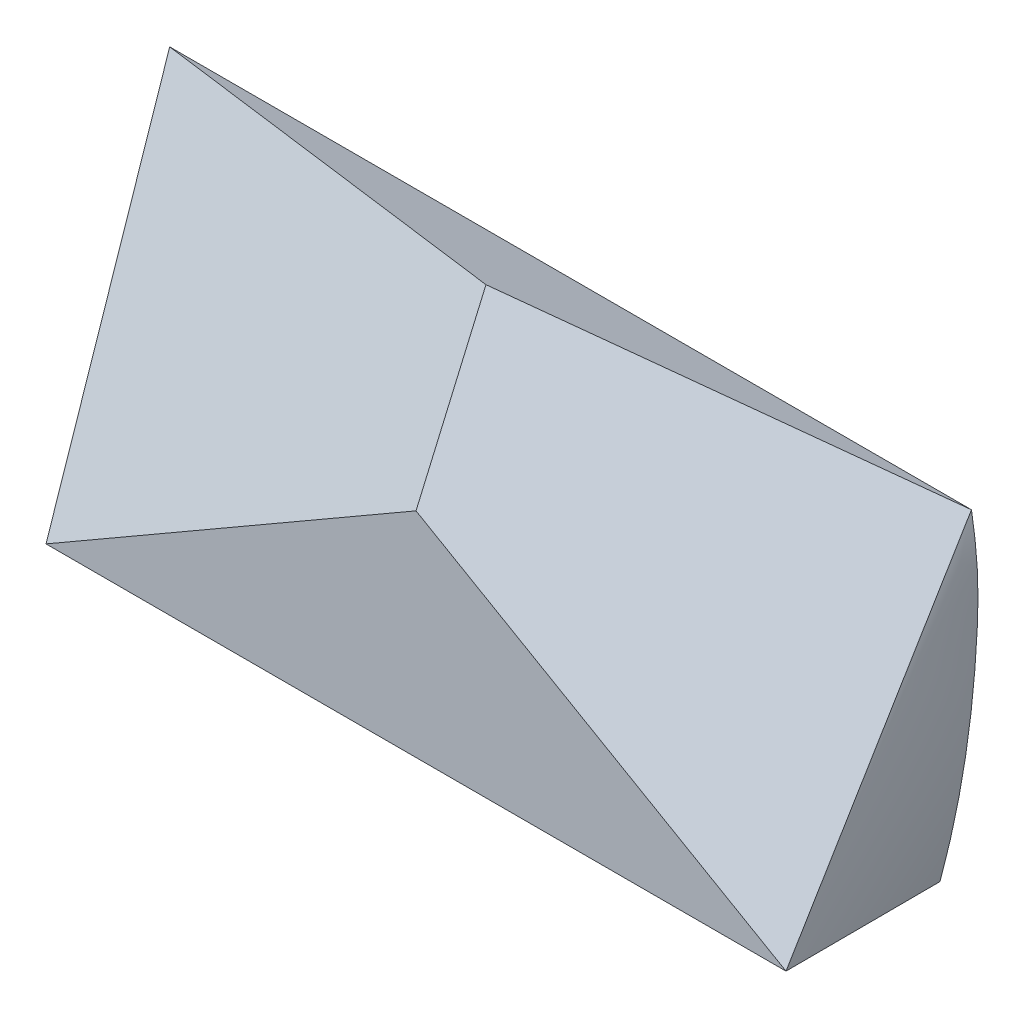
ISO-10303-21;
HEADER;
FILE_DESCRIPTION(('STEP AP214'),'2;1');
FILE_NAME('part.step','',(''),(''),'','','');
FILE_SCHEMA(('AUTOMOTIVE_DESIGN { 1 0 10303 214 1 1 1 1 }'));
ENDSEC;
DATA;
#1=APPLICATION_CONTEXT('core data for automotive mechanical design processes');
#2=APPLICATION_PROTOCOL_DEFINITION('international standard','automotive_design',2000,#1);
#3=PRODUCT_CONTEXT('',#1,'mechanical');
#4=PRODUCT('Part','Part','',(#3));
#5=PRODUCT_RELATED_PRODUCT_CATEGORY('part','',(#4));
#6=PRODUCT_DEFINITION_FORMATION('','',#4);
#7=PRODUCT_DEFINITION_CONTEXT('part definition',#1,'design');
#8=PRODUCT_DEFINITION('design','',#6,#7);
#9=PRODUCT_DEFINITION_SHAPE('','',#8);
#10=(LENGTH_UNIT() NAMED_UNIT(*) SI_UNIT(.MILLI.,.METRE.));
#11=(NAMED_UNIT(*) PLANE_ANGLE_UNIT() SI_UNIT($,.RADIAN.));
#12=(NAMED_UNIT(*) SI_UNIT($,.STERADIAN.) SOLID_ANGLE_UNIT());
#13=UNCERTAINTY_MEASURE_WITH_UNIT(LENGTH_MEASURE(1.E-05),#10,'distance_accuracy_value','');
#14=(GEOMETRIC_REPRESENTATION_CONTEXT(3) GLOBAL_UNCERTAINTY_ASSIGNED_CONTEXT((#13)) GLOBAL_UNIT_ASSIGNED_CONTEXT((#10,
#11,#12)) REPRESENTATION_CONTEXT('',''));
#15=CARTESIAN_POINT('',(0.,0.,0.));
#16=DIRECTION('',(0.,0.,1.));
#17=DIRECTION('',(1.,0.,0.));
#18=AXIS2_PLACEMENT_3D('',#15,#16,#17);
#19=CARTESIAN_POINT('',(0.,34.9116,-107.7276));
#20=DIRECTION('',(0.,0.,1.));
#21=DIRECTION('',(1.,0.,0.));
#22=AXIS2_PLACEMENT_3D('',#19,#20,#21);
#23=PLANE('',#22);
#24=CARTESIAN_POINT('',(-17.6616644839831,38.1174632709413,-107.7276));
#25=CARTESIAN_POINT('',(-17.6997094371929,37.9053981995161,-107.7276));
#26=CARTESIAN_POINT('',(-17.7341651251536,37.6926833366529,-107.7276));
#27=CARTESIAN_POINT('',(-17.7956552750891,37.2664553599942,-107.7276));
#28=CARTESIAN_POINT('',(-17.8226989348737,37.0529435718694,-107.7276));
#29=CARTESIAN_POINT('',(-17.8692025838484,36.6252367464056,-107.7276));
#30=CARTESIAN_POINT('',(-17.8886676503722,36.41104226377,-107.7276));
#31=CARTESIAN_POINT('',(-17.9196266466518,35.982787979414,-107.7276));
#32=CARTESIAN_POINT('',(-17.9311467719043,35.7687300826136,-107.7276));
#33=CARTESIAN_POINT('',(-17.9461106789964,35.3402925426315,-107.7276));
#34=CARTESIAN_POINT('',(-17.9495530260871,35.1259128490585,-107.7276));
#35=CARTESIAN_POINT('',(-17.9491639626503,34.8043343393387,-107.7276));
#36=CARTESIAN_POINT('',(-17.9481081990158,34.6971219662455,-107.7276));
#37=CARTESIAN_POINT('',(-17.9443804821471,34.4827243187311,-107.7276));
#38=CARTESIAN_POINT('',(-17.9417085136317,34.3755390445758,-107.7276));
#39=CARTESIAN_POINT('',(-17.9348336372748,34.1529513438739,-107.7276));
#40=CARTESIAN_POINT('',(-17.9305286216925,34.0375521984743,-107.7276));
#41=CARTESIAN_POINT('',(-17.9207823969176,33.806802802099,-107.7276));
#42=CARTESIAN_POINT('',(-17.9153411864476,33.6914525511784,-107.7276));
#43=CARTESIAN_POINT('',(-17.8976663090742,33.345459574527,-107.7276));
#44=CARTESIAN_POINT('',(-17.8840817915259,33.1148857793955,-107.7276));
#45=CARTESIAN_POINT('',(-17.8540475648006,32.653913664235,-107.7276));
#46=CARTESIAN_POINT('',(-17.837597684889,32.4235153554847,-107.7276));
#47=CARTESIAN_POINT('',(-17.8016910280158,31.96295374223,-107.7276));
#48=CARTESIAN_POINT('',(-17.7822342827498,31.7327904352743,-107.7276));
#49=CARTESIAN_POINT('',(-17.7399298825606,31.272047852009,-107.7276));
#50=CARTESIAN_POINT('',(-17.7170718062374,31.0414695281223,-107.7276));
#51=CARTESIAN_POINT('',(-17.6678470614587,30.5807226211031,-107.7276));
#52=CARTESIAN_POINT('',(-17.6414809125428,30.3505539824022,-107.7276));
#53=CARTESIAN_POINT('',(-17.5855300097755,29.8906256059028,-107.7276));
#54=CARTESIAN_POINT('',(-17.5559454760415,29.660865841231,-107.7276));
#55=CARTESIAN_POINT('',(-17.4936746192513,29.2017702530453,-107.7276));
#56=CARTESIAN_POINT('',(-17.4609883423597,28.9724344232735,-107.7276));
#57=CARTESIAN_POINT('',(-17.391882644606,28.5108276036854,-107.7276));
#58=CARTESIAN_POINT('',(-17.3554148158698,28.2785638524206,-107.7276));
#59=CARTESIAN_POINT('',(-17.2791356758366,27.8145706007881,-107.7276));
#60=CARTESIAN_POINT('',(-17.2393241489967,27.5828411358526,-107.7276));
#61=CARTESIAN_POINT('',(-17.1563394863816,27.1199743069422,-107.7276));
#62=CARTESIAN_POINT('',(-17.1131662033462,26.8888369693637,-107.7276));
#63=CARTESIAN_POINT('',(-17.0234619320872,26.4272085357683,-107.7276));
#64=CARTESIAN_POINT('',(-16.976930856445,26.1967174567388,-107.7276));
#65=CARTESIAN_POINT('',(-16.8807974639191,25.7377038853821,-107.7276));
#66=CARTESIAN_POINT('',(-16.8312135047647,25.5091775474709,-107.7276));
#67=CARTESIAN_POINT('',(-16.7287881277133,25.0528626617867,-107.7276));
#68=CARTESIAN_POINT('',(-16.6759467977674,24.8250740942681,-107.7276));
#69=CARTESIAN_POINT('',(-16.5670747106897,24.3702755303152,-107.7276));
#70=CARTESIAN_POINT('',(-16.5110441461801,24.1432654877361,-107.7276));
#71=CARTESIAN_POINT('',(-16.3958993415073,23.6900544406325,-107.7276));
#72=CARTESIAN_POINT('',(-16.336785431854,23.4638533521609,-107.7276));
#73=CARTESIAN_POINT('',(-16.2761781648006,23.2380545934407,-107.7276));
#74=B_SPLINE_CURVE_WITH_KNOTS('',3,(#24,#25,#26,#27,#28,#29,#30,#31,#32,#33,#34,#35,#36,#37,#38,
#39,#40,#41,#42,#43,#44,#45,#46,#47,#48,#49,#50,#51,#52,#53,#54,#55,#56,#57,#58,#59,#60,#61,#62,
#63,#64,#65,#66,#67,#68,#69,#70,#71,#72,#73),.UNSPECIFIED.,.F.,.F.,(4,2,2,2,2,2,2,2,2,2,2,2,2,2,
2,2,2,2,2,2,2,2,2,2,4),(0.,0.646329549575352,1.291853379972,1.93694398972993,2.57989735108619,
3.22296490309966,3.54460694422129,3.86625202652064,4.21268318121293,4.55911472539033,
5.25201129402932,5.94494916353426,6.63787972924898,7.33297884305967,8.0279751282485,
8.72292390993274,9.41786235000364,10.1231656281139,10.828514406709,11.5338941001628,
12.239292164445,12.9407990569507,13.6422870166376,14.3437326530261,15.0451032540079),.UNSPECIFIED.);
#75=CARTESIAN_POINT('',(-17.6615252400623,38.1174382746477,-107.727588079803));
#76=VERTEX_POINT('',#75);
#77=CARTESIAN_POINT('',(-16.2760545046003,23.2380877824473,-107.727587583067));
#78=VERTEX_POINT('',#77);
#79=EDGE_CURVE('E173',#76,#78,#74,.T.);
#80=ORIENTED_EDGE('',*,*,#79,.F.);
#81=DIRECTION('',(-1.,0.,0.));
#82=VECTOR('',#81,1.);
#83=CARTESIAN_POINT('',(-17.6613993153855,38.11745,-107.7276));
#84=LINE('',#83,#82);
#85=CARTESIAN_POINT('',(17.6615252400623,38.1174382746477,-107.727588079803));
#86=VERTEX_POINT('',#85);
#87=EDGE_CURVE('E163',#86,#76,#84,.T.);
#88=ORIENTED_EDGE('',*,*,#87,.F.);
#89=CARTESIAN_POINT('',(17.6616644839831,38.1174632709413,-107.7276));
#90=CARTESIAN_POINT('',(17.6997094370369,37.9053982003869,-107.7276));
#91=CARTESIAN_POINT('',(17.7341651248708,37.6926833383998,-107.7276));
#92=CARTESIAN_POINT('',(17.7956552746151,37.2664553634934,-107.7276));
#93=CARTESIAN_POINT('',(17.822698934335,37.0529435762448,-107.7276));
#94=CARTESIAN_POINT('',(17.8692025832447,36.6252367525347,-107.7276));
#95=CARTESIAN_POINT('',(17.8886676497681,36.4110422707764,-107.7276));
#96=CARTESIAN_POINT('',(17.9196266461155,35.9827879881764,-107.7276));
#97=CARTESIAN_POINT('',(17.931146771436,35.7687300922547,-107.7276));
#98=CARTESIAN_POINT('',(17.9461106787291,35.3402925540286,-107.7276));
#99=CARTESIAN_POINT('',(17.949553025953,35.1259128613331,-107.7276));
#100=CARTESIAN_POINT('',(17.949163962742,34.804334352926,-107.7276));
#101=CARTESIAN_POINT('',(17.9481081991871,34.6971219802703,-107.7276));
#102=CARTESIAN_POINT('',(17.9443804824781,34.4827243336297,-107.7276));
#103=CARTESIAN_POINT('',(17.9417085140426,34.3755390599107,-107.7276));
#104=CARTESIAN_POINT('',(17.9348336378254,34.1529513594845,-107.7276));
#105=CARTESIAN_POINT('',(17.9305286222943,34.0375522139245,-107.7276));
#106=CARTESIAN_POINT('',(17.9207823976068,33.8068028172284,-107.7276));
#107=CARTESIAN_POINT('',(17.9153411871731,33.6914525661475,-107.7276));
#108=CARTESIAN_POINT('',(17.8976663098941,33.3454595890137,-107.7276));
#109=CARTESIAN_POINT('',(17.8840817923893,33.1148857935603,-107.7276));
#110=CARTESIAN_POINT('',(17.8540475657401,32.6539136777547,-107.7276));
#111=CARTESIAN_POINT('',(17.8375976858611,32.4235153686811,-107.7276));
#112=CARTESIAN_POINT('',(17.8016910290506,31.9629537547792,-107.7276));
#113=CARTESIAN_POINT('',(17.7822342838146,31.7327904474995,-107.7276));
#114=CARTESIAN_POINT('',(17.7399298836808,31.2720478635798,-107.7276));
#115=CARTESIAN_POINT('',(17.7170718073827,31.0414695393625,-107.7276));
#116=CARTESIAN_POINT('',(17.6678470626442,30.5807226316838,-107.7276));
#117=CARTESIAN_POINT('',(17.6414809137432,30.3505539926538,-107.7276));
#118=CARTESIAN_POINT('',(17.5855300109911,29.8906256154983,-107.7276));
#119=CARTESIAN_POINT('',(17.555945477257,29.6608658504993,-107.7276));
#120=CARTESIAN_POINT('',(17.4936746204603,29.2017702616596,-107.7276));
#121=CARTESIAN_POINT('',(17.4609883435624,28.9724344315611,-107.7276));
#122=CARTESIAN_POINT('',(17.3918826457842,28.5108276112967,-107.7276));
#123=CARTESIAN_POINT('',(17.3554148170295,28.2785638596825,-107.7276));
#124=CARTESIAN_POINT('',(17.2791356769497,27.8145706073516,-107.7276));
#125=CARTESIAN_POINT('',(17.2393241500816,27.5828411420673,-107.7276));
#126=CARTESIAN_POINT('',(17.1563394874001,27.1199743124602,-107.7276));
#127=CARTESIAN_POINT('',(17.1131662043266,26.8888369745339,-107.7276));
#128=CARTESIAN_POINT('',(17.0234619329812,26.4272085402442,-107.7276));
#129=CARTESIAN_POINT('',(16.9769308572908,26.1967174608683,-107.7276));
#130=CARTESIAN_POINT('',(16.8807974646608,25.7377038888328,-107.7276));
#131=CARTESIAN_POINT('',(16.8312135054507,25.5091775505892,-107.7276));
#132=CARTESIAN_POINT('',(16.7287881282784,25.0528626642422,-107.7276));
#133=CARTESIAN_POINT('',(16.6759467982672,24.8250740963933,-107.7276));
#134=CARTESIAN_POINT('',(16.5670747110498,24.3702755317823,-107.7276));
#135=CARTESIAN_POINT('',(16.5110441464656,24.1432654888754,-107.7276));
#136=CARTESIAN_POINT('',(16.3958993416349,23.6900544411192,-107.7276));
#137=CARTESIAN_POINT('',(16.3367854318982,23.4638533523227,-107.7276));
#138=CARTESIAN_POINT('',(16.2761781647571,23.2380545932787,-107.7276));
#139=B_SPLINE_CURVE_WITH_KNOTS('',3,(#89,#90,#91,#92,#93,#94,#95,#96,#97,#98,#99,#100,#101,#102,
#103,#104,#105,#106,#107,#108,#109,#110,#111,#112,#113,#114,#115,#116,#117,#118,#119,#120,#121,
#122,#123,#124,#125,#126,#127,#128,#129,#130,#131,#132,#133,#134,#135,#136,#137,#138),
.UNSPECIFIED.,.F.,.F.,(4,2,2,2,2,2,2,2,2,2,2,2,2,2,2,2,2,2,2,2,2,2,2,2,4),(0.,0.646329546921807,
1.29185337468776,1.93694398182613,2.5798973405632,3.22296488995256,3.54460692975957,
3.86625201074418,4.21268316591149,4.55911471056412,5.25201128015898,5.94494915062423,
6.6378797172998,7.33297883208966,8.02797511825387,8.72292390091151,9.41786234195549,
10.12316562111,10.8285144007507,11.5338940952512,12.2392921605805,12.9407990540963,
13.6422870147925,14.3437326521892,15.0451032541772),.UNSPECIFIED.);
#140=CARTESIAN_POINT('',(16.2760545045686,23.2380877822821,-107.727587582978));
#141=VERTEX_POINT('',#140);
#142=EDGE_CURVE('E158',#86,#141,#139,.T.);
#143=ORIENTED_EDGE('',*,*,#142,.T.);
#144=CARTESIAN_POINT('',(-16.2759232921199,23.2381,-107.7276));
#145=CARTESIAN_POINT('',(-5.42530776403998,23.2381,-107.7276));
#146=CARTESIAN_POINT('',(5.42530776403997,23.2381,-107.7276));
#147=CARTESIAN_POINT('',(16.2759232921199,23.2381,-107.7276));
#148=B_SPLINE_CURVE_WITH_KNOTS('',3,(#144,#145,#146,#147),.UNSPECIFIED.,.F.,.F.,(4,4),(0.,1.),.UNSPECIFIED.);
#149=EDGE_CURVE('E161',#141,#78,#148,.F.);
#150=ORIENTED_EDGE('',*,*,#149,.T.);
#151=EDGE_LOOP('',(#80,#88,#143,#150));
#152=FACE_BOUND('',#151,.T.);
#153=ADVANCED_FACE('F113',(#152),#23,.F.);
#154=CARTESIAN_POINT('',(16.2890614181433,23.0988148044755,-100.812618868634));
#155=CARTESIAN_POINT('',(16.2719645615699,22.9579192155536,-101.360325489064));
#156=CARTESIAN_POINT('',(16.2498134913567,22.8174942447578,-101.908746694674));
#157=CARTESIAN_POINT('',(16.2225945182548,22.6775411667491,-102.457884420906));
#158=CARTESIAN_POINT('',(16.1779443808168,22.485803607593,-103.213873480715));
#159=CARTESIAN_POINT('',(16.1229711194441,22.2950272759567,-103.971322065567));
#160=CARTESIAN_POINT('',(16.1072041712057,22.2430878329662,-104.177938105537));
#161=CARTESIAN_POINT('',(16.0464706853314,22.0528159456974,-104.936323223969));
#162=CARTESIAN_POINT('',(15.9750508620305,21.8635391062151,-105.696219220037));
#163=CARTESIAN_POINT('',(15.9172431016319,21.7264023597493,-106.249803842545));
#164=CARTESIAN_POINT('',(15.8537511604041,21.5897948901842,-106.804192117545));
#165=CARTESIAN_POINT('',(15.7846019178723,21.4537141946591,-107.3593802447));
#166=CARTESIAN_POINT('',(16.4365015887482,24.7155021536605,-101.242335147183));
#167=CARTESIAN_POINT('',(16.4438470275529,24.5723306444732,-101.786586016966));
#168=CARTESIAN_POINT('',(16.4461496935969,24.4296286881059,-102.331549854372));
#169=CARTESIAN_POINT('',(16.4432954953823,24.287406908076,-102.877242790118));
#170=CARTESIAN_POINT('',(16.4324556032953,24.0925211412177,-103.628451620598));
#171=CARTESIAN_POINT('',(16.4119866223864,23.898531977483,-104.381021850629));
#172=CARTESIAN_POINT('',(16.4056906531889,23.8457106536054,-104.58629884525));
#173=CARTESIAN_POINT('',(16.379803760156,23.6521940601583,-105.33975721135));
#174=CARTESIAN_POINT('',(16.3433546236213,23.4596609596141,-106.094708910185));
#175=CARTESIAN_POINT('',(16.3113634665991,23.320120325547,-106.64464347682));
#176=CARTESIAN_POINT('',(16.2738809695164,23.1810910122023,-107.195354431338));
#177=CARTESIAN_POINT('',(16.2307777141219,23.0425850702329,-107.746860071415));
#178=CARTESIAN_POINT('',(16.5571621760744,26.3346830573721,-101.675837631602));
#179=CARTESIAN_POINT('',(16.5889599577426,26.1892346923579,-102.216631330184));
#180=CARTESIAN_POINT('',(16.615908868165,26.0442378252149,-102.758110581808));
#181=CARTESIAN_POINT('',(16.6384553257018,25.8996508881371,-103.30021227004));
#182=CARTESIAN_POINT('',(16.6622875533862,25.7015366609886,-104.046519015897));
#183=CARTESIAN_POINT('',(16.6762288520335,25.5043434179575,-104.794224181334));
#184=CARTESIAN_POINT('',(16.6792905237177,25.4506507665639,-104.998178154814));
#185=CARTESIAN_POINT('',(16.6882937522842,25.253885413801,-105.746703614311));
#186=CARTESIAN_POINT('',(16.6896600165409,25.0578311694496,-106.496308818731));
#187=CARTESIAN_POINT('',(16.6857008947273,24.9156803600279,-107.042280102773));
#188=CARTESIAN_POINT('',(16.6754878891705,24.7741118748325,-107.58913558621));
#189=CARTESIAN_POINT('',(16.6597171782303,24.6330608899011,-108.136776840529));
#190=CARTESIAN_POINT('',(16.6421714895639,27.9571835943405,-102.114380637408));
#191=CARTESIAN_POINT('',(16.6997963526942,27.8093303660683,-102.651522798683));
#192=CARTESIAN_POINT('',(16.7530408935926,27.6618850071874,-103.189284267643));
#193=CARTESIAN_POINT('',(16.8012041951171,27.5149127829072,-103.727764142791));
#194=CARTESIAN_POINT('',(16.8625463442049,27.3133058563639,-104.468767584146));
#195=CARTESIAN_POINT('',(16.9161624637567,27.1124183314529,-105.210863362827));
#196=CARTESIAN_POINT('',(16.930179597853,27.0577055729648,-105.41326840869));
#197=CARTESIAN_POINT('',(16.9786466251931,26.8572655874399,-106.156214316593));
#198=CARTESIAN_POINT('',(17.0153288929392,26.6579229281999,-106.900826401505));
#199=CARTESIAN_POINT('',(17.0367355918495,26.5134102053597,-107.443211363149));
#200=CARTESIAN_POINT('',(17.0538203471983,26.3692999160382,-107.986207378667));
#201=CARTESIAN_POINT('',(17.0653664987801,26.2257053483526,-108.529986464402));
#202=CARTESIAN_POINT('',(16.7310354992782,30.4094314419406,-102.781776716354));
#203=CARTESIAN_POINT('',(16.827208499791,30.2579888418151,-103.313468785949));
#204=CARTESIAN_POINT('',(16.919353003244,30.1069213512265,-103.845730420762));
#205=CARTESIAN_POINT('',(17.0084846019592,29.9561344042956,-104.378418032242));
#206=CARTESIAN_POINT('',(17.1241085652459,29.7494730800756,-105.111746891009));
#207=CARTESIAN_POINT('',(17.2298684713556,29.5437302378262,-105.846470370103));
#208=CARTESIAN_POINT('',(17.2579603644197,29.4877069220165,-106.046885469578));
#209=CARTESIAN_POINT('',(17.3590526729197,29.2823667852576,-106.782391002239));
#210=CARTESIAN_POINT('',(17.4531353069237,29.0776793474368,-107.518887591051));
#211=CARTESIAN_POINT('',(17.5149794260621,28.9294013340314,-108.05555534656));
#212=CARTESIAN_POINT('',(17.5686821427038,28.7818813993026,-108.593374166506));
#213=CARTESIAN_POINT('',(17.6158546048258,28.6349695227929,-109.132116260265));
#214=CARTESIAN_POINT('',(16.7001824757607,32.8728266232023,-103.466098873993));
#215=CARTESIAN_POINT('',(16.8483679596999,32.7165409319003,-103.990437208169));
#216=CARTESIAN_POINT('',(16.9919829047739,32.5606808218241,-104.515421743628));
#217=CARTESIAN_POINT('',(17.1304305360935,32.4053018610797,-105.04113685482));
#218=CARTESIAN_POINT('',(17.316147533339,32.1921138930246,-105.764555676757));
#219=CARTESIAN_POINT('',(17.4927027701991,31.9797790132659,-106.489269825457));
#220=CARTESIAN_POINT('',(17.5400920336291,31.9219588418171,-106.686956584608));
#221=CARTESIAN_POINT('',(17.7102929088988,31.7101837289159,-107.412691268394));
#222=CARTESIAN_POINT('',(17.8661931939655,31.4997402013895,-108.140447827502));
#223=CARTESIAN_POINT('',(17.9730974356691,31.3472664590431,-108.67074480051));
#224=CARTESIAN_POINT('',(18.0736809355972,31.1953812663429,-109.201935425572));
#225=CARTESIAN_POINT('',(18.1669483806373,31.0441773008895,-109.734160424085));
#226=CARTESIAN_POINT('',(16.6725075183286,33.7055097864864,-103.699409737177));
#227=CARTESIAN_POINT('',(16.8411143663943,33.5473225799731,-104.220860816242));
#228=CARTESIAN_POINT('',(17.0048919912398,33.3895850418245,-104.74299467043));
#229=CARTESIAN_POINT('',(17.1642967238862,33.232254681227,-105.265746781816));
#230=CARTESIAN_POINT('',(17.3701100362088,33.0171954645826,-105.986324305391));
#231=CARTESIAN_POINT('',(17.5657356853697,32.8030848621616,-106.708342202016));
#232=CARTESIAN_POINT('',(17.6184842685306,32.7447656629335,-106.905271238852));
#233=CARTESIAN_POINT('',(17.8113131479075,32.5308835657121,-107.627806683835));
#234=CARTESIAN_POINT('',(17.998501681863,32.3175266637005,-108.351139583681));
#235=CARTESIAN_POINT('',(18.1261102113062,32.1631250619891,-108.878509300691));
#236=CARTESIAN_POINT('',(18.2458686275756,32.0094544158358,-109.406988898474));
#237=CARTESIAN_POINT('',(18.3572955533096,31.8565595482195,-109.936646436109));
#238=CARTESIAN_POINT('',(16.5618785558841,35.2885698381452,-104.149679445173));
#239=CARTESIAN_POINT('',(16.7752299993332,35.1262162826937,-104.664804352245));
#240=CARTESIAN_POINT('',(16.9847629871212,34.9642182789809,-105.180469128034));
#241=CARTESIAN_POINT('',(17.1911492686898,34.8025132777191,-105.696578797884));
#242=CARTESIAN_POINT('',(17.4673307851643,34.5809017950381,-106.407207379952));
#243=CARTESIAN_POINT('',(17.7274726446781,34.3607838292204,-107.12010371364));
#244=CARTESIAN_POINT('',(17.7970613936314,34.3008965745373,-107.314651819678));
#245=CARTESIAN_POINT('',(18.0471924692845,34.0816788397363,-108.029085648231));
#246=CARTESIAN_POINT('',(18.28564786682,33.8635482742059,-108.74517023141));
#247=CARTESIAN_POINT('',(18.4549568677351,33.7052637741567,-109.266644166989));
#248=CARTESIAN_POINT('',(18.6113465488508,33.5481822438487,-109.789944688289));
#249=CARTESIAN_POINT('',(18.7583930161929,33.3919706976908,-110.314566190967));
#250=CARTESIAN_POINT('',(16.3557054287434,36.8805263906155,-104.613457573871));
#251=CARTESIAN_POINT('',(16.6204511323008,36.7133873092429,-105.12131615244));
#252=CARTESIAN_POINT('',(16.883015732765,36.546451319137,-105.629483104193));
#253=CARTESIAN_POINT('',(17.1423999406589,36.3798114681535,-106.138099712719));
#254=CARTESIAN_POINT('',(17.500308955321,36.1505900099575,-106.837173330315));
#255=CARTESIAN_POINT('',(17.8469680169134,35.9224160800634,-107.53783751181));
#256=CARTESIAN_POINT('',(17.9403261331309,35.8603155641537,-107.729025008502));
#257=CARTESIAN_POINT('',(18.275983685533,35.6331341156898,-108.431366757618));
#258=CARTESIAN_POINT('',(18.5819038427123,35.408721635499,-109.137912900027));
#259=CARTESIAN_POINT('',(18.7912455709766,35.2467095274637,-109.653726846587));
#260=CARTESIAN_POINT('',(18.9916544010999,35.0855291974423,-110.170803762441));
#261=CARTESIAN_POINT('',(19.1805408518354,34.9254217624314,-110.689509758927));
#262=CARTESIAN_POINT('',(16.24040259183,37.6339154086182,-104.834990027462));
#263=CARTESIAN_POINT('',(16.5303734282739,37.4644275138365,-105.339282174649));
#264=CARTESIAN_POINT('',(16.8186036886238,37.2951016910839,-105.843820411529));
#265=CARTESIAN_POINT('',(17.1049974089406,37.1259468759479,-106.348618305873));
#266=CARTESIAN_POINT('',(17.4991470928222,36.8933509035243,-107.042568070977));
#267=CARTESIAN_POINT('',(17.8793056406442,36.6620577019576,-107.738495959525));
#268=CARTESIAN_POINT('',(17.9814305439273,36.5991408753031,-107.92844397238));
#269=CARTESIAN_POINT('',(18.350641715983,36.368835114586,-108.626041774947));
#270=CARTESIAN_POINT('',(18.6998704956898,36.1403899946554,-109.326464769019));
#271=CARTESIAN_POINT('',(18.9363934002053,35.9758469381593,-109.83843573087));
#272=CARTESIAN_POINT('',(19.1607175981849,35.81243975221,-110.352131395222));
#273=CARTESIAN_POINT('',(19.3725282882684,35.6501977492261,-110.867596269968));
#274=CARTESIAN_POINT('',(16.1117643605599,38.3885461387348,-105.058407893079));
#275=CARTESIAN_POINT('',(16.4273579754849,38.2166724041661,-105.559077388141));
#276=CARTESIAN_POINT('',(16.7414940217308,38.0449343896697,-106.059952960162));
#277=CARTESIAN_POINT('',(17.0540423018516,37.8733442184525,-106.561053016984));
#278=CARTESIAN_POINT('',(17.4841406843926,37.6374009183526,-107.249920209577));
#279=CARTESIAN_POINT('',(17.9010847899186,37.4026824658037,-107.940647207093));
#280=CARTESIAN_POINT('',(18.0134115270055,37.3388157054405,-108.129152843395));
#281=CARTESIAN_POINT('',(18.4195452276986,37.1050719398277,-108.821530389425));
#282=CARTESIAN_POINT('',(18.8013440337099,36.8735940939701,-109.517348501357));
#283=CARTESIAN_POINT('',(19.0638471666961,36.7066319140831,-110.025646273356));
#284=CARTESIAN_POINT('',(19.3130433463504,36.5409087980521,-110.535825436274));
#285=CARTESIAN_POINT('',(19.5492114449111,36.3763987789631,-111.047846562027));
#286=CARTESIAN_POINT('',(15.9687929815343,39.1445114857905,-105.283852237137));
#287=CARTESIAN_POINT('',(16.3100901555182,38.9702443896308,-105.780887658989));
#288=CARTESIAN_POINT('',(16.6499437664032,38.7961117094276,-106.278127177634));
#289=CARTESIAN_POINT('',(16.9885917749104,38.6220912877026,-106.775537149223));
#290=CARTESIAN_POINT('',(17.4540791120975,38.382852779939,-107.459400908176));
#291=CARTESIAN_POINT('',(17.9068427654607,38.1447990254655,-108.145063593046));
#292=CARTESIAN_POINT('',(18.0289866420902,38.0800181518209,-108.332181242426));
#293=CARTESIAN_POINT('',(18.4710892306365,37.8429251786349,-109.019473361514));
#294=CARTESIAN_POINT('',(18.888966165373,37.6080879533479,-109.710190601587));
#295=CARTESIAN_POINT('',(19.1766728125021,37.4387789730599,-110.214924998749));
#296=CARTESIAN_POINT('',(19.4507084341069,37.2707429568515,-110.721592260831));
#297=CARTESIAN_POINT('',(19.7114635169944,37.1039435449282,-111.230137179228));
#298=B_SPLINE_SURFACE_WITH_KNOTS('',5,5,((#154,#155,#156,#157,#158,#159,#160,#161,#162,#163,
#164,#165),(#166,#167,#168,#169,#170,#171,#172,#173,#174,#175,#176,#177),(#178,#179,#180,#181,
#182,#183,#184,#185,#186,#187,#188,#189),(#190,#191,#192,#193,#194,#195,#196,#197,#198,#199,
#200,#201),(#202,#203,#204,#205,#206,#207,#208,#209,#210,#211,#212,#213),(#214,#215,#216,#217,
#218,#219,#220,#221,#222,#223,#224,#225),(#226,#227,#228,#229,#230,#231,#232,#233,#234,#235,
#236,#237),(#238,#239,#240,#241,#242,#243,#244,#245,#246,#247,#248,#249),(#250,#251,#252,#253,
#254,#255,#256,#257,#258,#259,#260,#261),(#262,#263,#264,#265,#266,#267,#268,#269,#270,#271,
#272,#273),(#274,#275,#276,#277,#278,#279,#280,#281,#282,#283,#284,#285),(#286,#287,#288,#289,
#290,#291,#292,#293,#294,#295,#296,#297)),.UNSPECIFIED.,.F.,.F.,.F.,(6,3,3,6),(6,3,3,6),
(-7.75575423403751,0.63487937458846,4.90686694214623,8.72879116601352),(-3.33479451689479,
-0.534425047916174,0.515217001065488,3.31621367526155),.UNSPECIFIED.);
#299=CARTESIAN_POINT('',(16.3014175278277,23.2381,-100.917753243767));
#300=CARTESIAN_POINT('',(16.3002078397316,23.2381,-101.228294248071));
#301=CARTESIAN_POINT('',(16.2990216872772,23.2381,-101.538835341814));
#302=CARTESIAN_POINT('',(16.2966749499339,23.2381000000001,-102.159917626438));
#303=CARTESIAN_POINT('',(16.2955143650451,23.2381000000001,-102.470458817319));
#304=CARTESIAN_POINT('',(16.2931972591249,23.2381000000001,-103.091541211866));
#305=CARTESIAN_POINT('',(16.2920407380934,23.2381,-103.402082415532));
#306=CARTESIAN_POINT('',(16.2897195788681,23.2381,-104.023164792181));
#307=CARTESIAN_POINT('',(16.2885549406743,23.2381000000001,-104.333705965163));
#308=CARTESIAN_POINT('',(16.285464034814,23.2381000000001,-105.158137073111));
#309=CARTESIAN_POINT('',(16.2835384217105,23.2381000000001,-105.672027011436));
#310=CARTESIAN_POINT('',(16.2797760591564,23.2381,-106.699807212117));
#311=CARTESIAN_POINT('',(16.2779393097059,23.2381,-107.213697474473));
#312=CARTESIAN_POINT('',(16.2761903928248,23.2381,-107.727588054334));
#313=B_SPLINE_CURVE_WITH_KNOTS('',3,(#299,#300,#301,#302,#303,#304,#305,#306,#307,#308,#309,
#310,#311,#312),.UNSPECIFIED.,.F.,.F.,(4,2,2,2,2,2,4),(0.,0.931630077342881,1.86326015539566,
2.79489022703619,3.72652029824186,5.26820093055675,6.80988156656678),.UNSPECIFIED.);
#314=CARTESIAN_POINT('',(16.3013834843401,23.2380968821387,-100.917753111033));
#315=VERTEX_POINT('',#314);
#316=EDGE_CURVE('E167',#315,#141,#313,.T.);
#317=CARTESIAN_POINT('',(16.3014162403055,23.2380867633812,-100.917768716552));
#318=CARTESIAN_POINT('',(16.3296270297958,23.5480944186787,-101.059618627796));
#319=CARTESIAN_POINT('',(16.3579077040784,23.8580900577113,-101.201480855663));
#320=CARTESIAN_POINT('',(16.4145320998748,24.4780704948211,-101.485216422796));
#321=CARTESIAN_POINT('',(16.4428758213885,24.7880552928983,-101.627089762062));
#322=CARTESIAN_POINT('',(16.499549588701,25.4080272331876,-101.910834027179));
#323=CARTESIAN_POINT('',(16.5278796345,25.7180143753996,-102.05270495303));
#324=CARTESIAN_POINT('',(16.5845375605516,26.3379890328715,-102.336446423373));
#325=CARTESIAN_POINT('',(16.6128654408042,26.6479765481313,-102.478316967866));
#326=CARTESIAN_POINT('',(16.6978841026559,27.5779330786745,-102.903934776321));
#327=CARTESIAN_POINT('',(16.7546099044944,28.1978960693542,-103.187688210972));
#328=CARTESIAN_POINT('',(16.8397779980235,29.1278268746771,-103.613332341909));
#329=CARTESIAN_POINT('',(16.8681805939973,29.4378015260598,-103.755216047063));
#330=CARTESIAN_POINT('',(16.9249654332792,30.0577543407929,-104.038979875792));
#331=CARTESIAN_POINT('',(16.9533476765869,30.3677325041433,-104.180859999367));
#332=CARTESIAN_POINT('',(17.0100691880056,30.987696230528,-104.464612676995));
#333=CARTESIAN_POINT('',(17.038408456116,31.2976817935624,-104.606485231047));
#334=CARTESIAN_POINT('',(17.0950603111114,31.9176575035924,-104.890225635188));
#335=CARTESIAN_POINT('',(17.1233728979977,32.2276476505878,-105.032093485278));
#336=CARTESIAN_POINT('',(17.165705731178,32.6926562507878,-105.244871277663));
#337=CARTESIAN_POINT('',(17.1797940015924,32.8476630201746,-105.315793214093));
#338=CARTESIAN_POINT('',(17.2079555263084,33.1576791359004,-105.457634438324));
#339=CARTESIAN_POINT('',(17.2220287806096,33.3126884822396,-105.528553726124));
#340=CARTESIAN_POINT('',(17.2502112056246,33.6227010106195,-105.670398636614));
#341=CARTESIAN_POINT('',(17.264320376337,33.7777041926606,-105.741324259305));
#342=CARTESIAN_POINT('',(17.292634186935,34.0876941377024,-105.88319232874));
#343=CARTESIAN_POINT('',(17.3068388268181,34.2426809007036,-105.954134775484));
#344=CARTESIAN_POINT('',(17.3353287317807,34.5526405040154,-106.096033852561));
#345=CARTESIAN_POINT('',(17.3496139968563,34.7076133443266,-106.166990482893));
#346=CARTESIAN_POINT('',(17.3781436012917,35.0175660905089,-106.30889654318));
#347=CARTESIAN_POINT('',(17.3923879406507,35.1725459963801,-106.379845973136));
#348=CARTESIAN_POINT('',(17.4350929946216,35.6374905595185,-106.592689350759));
#349=CARTESIAN_POINT('',(17.4635257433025,35.9474600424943,-106.734578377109));
#350=CARTESIAN_POINT('',(17.5202384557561,36.5674252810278,-107.018329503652));
#351=CARTESIAN_POINT('',(17.5485184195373,36.8774210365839,-107.160191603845));
#352=CARTESIAN_POINT('',(17.6050767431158,37.4974128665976,-107.443915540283));
#353=CARTESIAN_POINT('',(17.6333551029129,37.8074089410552,-107.585777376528));
#354=CARTESIAN_POINT('',(17.6617082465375,38.1173921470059,-107.727652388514));
#355=B_SPLINE_CURVE_WITH_KNOTS('',3,(#317,#318,#319,#320,#321,#322,#323,#324,#325,#326,#327,
#328,#329,#330,#331,#332,#333,#334,#335,#336,#337,#338,#339,#340,#341,#342,#343,#344,#345,#346,
#347,#348,#349,#350,#351,#352,#353,#354),.UNSPECIFIED.,.F.,.F.,(4,2,2,2,2,2,2,2,2,2,2,2,2,2,2,2,
2,2,4),(0.,1.02625428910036,2.05250857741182,3.07876284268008,4.10501710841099,6.15752567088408,
7.18377992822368,8.21003420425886,9.23628849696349,10.2625427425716,10.7756699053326,
11.2887970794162,11.8019242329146,12.3150513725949,12.8281784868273,13.3413056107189,
14.3675599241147,15.3938141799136,16.420068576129),.UNSPECIFIED.);
#356=EDGE_CURVE('E170',#315,#86,#355,.T.);
#357=ORIENTED_EDGE('',*,*,#316,.T.);
#358=ORIENTED_EDGE('',*,*,#142,.F.);
#359=ORIENTED_EDGE('',*,*,#356,.F.);
#360=EDGE_LOOP('',(#357,#358,#359));
#361=FACE_BOUND('',#360,.T.);
#362=ADVANCED_FACE('F168',(#361),#298,.F.);
#363=CARTESIAN_POINT('',(-16.30135,23.2381,-100.917757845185));
#364=DIRECTION('',(0.,1.,0.));
#365=DIRECTION('',(1.,0.,0.));
#366=AXIS2_PLACEMENT_3D('',#363,#364,#365);
#367=PLANE('',#366);
#368=DIRECTION('',(1.,0.,0.));
#369=VECTOR('',#368,1.);
#370=CARTESIAN_POINT('',(-16.30135,23.2381,-100.917757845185));
#371=LINE('',#370,#369);
#372=CARTESIAN_POINT('',(-16.3013834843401,23.2380968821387,-100.917753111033));
#373=VERTEX_POINT('',#372);
#374=EDGE_CURVE('E138',#373,#315,#371,.T.);
#375=ORIENTED_EDGE('',*,*,#374,.F.);
#376=CARTESIAN_POINT('',(-16.2761903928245,23.2381,-107.727588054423));
#377=CARTESIAN_POINT('',(-16.2772667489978,23.2381,-107.417046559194));
#378=CARTESIAN_POINT('',(-16.2783568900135,23.2381,-107.106505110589));
#379=CARTESIAN_POINT('',(-16.2805696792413,23.2381,-106.485422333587));
#380=CARTESIAN_POINT('',(-16.2816923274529,23.2381,-106.174881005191));
#381=CARTESIAN_POINT('',(-16.2851164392,23.2381,-105.243257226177));
#382=CARTESIAN_POINT('',(-16.2874740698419,23.2381,-104.622174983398));
#383=CARTESIAN_POINT('',(-16.2917280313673,23.2381,-103.487202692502));
#384=CARTESIAN_POINT('',(-16.2936337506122,23.2381,-102.973312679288));
#385=CARTESIAN_POINT('',(-16.297480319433,23.2381,-101.94553278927));
#386=CARTESIAN_POINT('',(-16.2994211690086,23.2381,-101.431642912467));
#387=CARTESIAN_POINT('',(-16.3014175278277,23.2381,-100.917753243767));
#388=B_SPLINE_CURVE_WITH_KNOTS('',3,(#376,#377,#378,#379,#380,#381,#382,#383,#384,#385,#386,
#387),.UNSPECIFIED.,.F.,.F.,(4,2,2,2,2,4),(0.,0.931630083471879,1.86326015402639,
3.72652030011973,5.26820093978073,6.80988156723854),.UNSPECIFIED.);
#389=EDGE_CURVE('E175',#78,#373,#388,.T.);
#390=ORIENTED_EDGE('',*,*,#389,.F.);
#391=ORIENTED_EDGE('',*,*,#149,.F.);
#392=ORIENTED_EDGE('',*,*,#316,.F.);
#393=EDGE_LOOP('',(#375,#390,#391,#392));
#394=FACE_BOUND('',#393,.T.);
#395=ADVANCED_FACE('F115',(#394),#367,.F.);
#396=CARTESIAN_POINT('',(-16.2890614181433,23.0988148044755,-100.812618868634));
#397=CARTESIAN_POINT('',(-16.2719645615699,22.9579192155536,-101.360325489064));
#398=CARTESIAN_POINT('',(-16.2498134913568,22.8174942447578,-101.908746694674));
#399=CARTESIAN_POINT('',(-16.2225945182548,22.677541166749,-102.457884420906));
#400=CARTESIAN_POINT('',(-16.1779443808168,22.4858036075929,-103.213873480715));
#401=CARTESIAN_POINT('',(-16.1229711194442,22.2950272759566,-103.971322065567));
#402=CARTESIAN_POINT('',(-16.1072041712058,22.2430878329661,-104.177938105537));
#403=CARTESIAN_POINT('',(-16.0464706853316,22.0528159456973,-104.936323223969));
#404=CARTESIAN_POINT('',(-15.9750508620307,21.863539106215,-105.696219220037));
#405=CARTESIAN_POINT('',(-15.9172431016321,21.7264023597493,-106.249803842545));
#406=CARTESIAN_POINT('',(-15.8537511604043,21.5897948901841,-106.804192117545));
#407=CARTESIAN_POINT('',(-15.7846019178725,21.453714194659,-107.3593802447));
#408=CARTESIAN_POINT('',(-16.4365015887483,24.7155021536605,-101.242335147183));
#409=CARTESIAN_POINT('',(-16.443847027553,24.5723306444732,-101.786586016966));
#410=CARTESIAN_POINT('',(-16.4461496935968,24.4296286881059,-102.331549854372));
#411=CARTESIAN_POINT('',(-16.4432954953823,24.287406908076,-102.877242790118));
#412=CARTESIAN_POINT('',(-16.4324556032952,24.0925211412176,-103.628451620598));
#413=CARTESIAN_POINT('',(-16.4119866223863,23.898531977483,-104.381021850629));
#414=CARTESIAN_POINT('',(-16.4056906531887,23.8457106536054,-104.58629884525));
#415=CARTESIAN_POINT('',(-16.3798037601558,23.6521940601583,-105.33975721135));
#416=CARTESIAN_POINT('',(-16.3433546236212,23.459660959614,-106.094708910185));
#417=CARTESIAN_POINT('',(-16.311363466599,23.320120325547,-106.64464347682));
#418=CARTESIAN_POINT('',(-16.2738809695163,23.1810910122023,-107.195354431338));
#419=CARTESIAN_POINT('',(-16.2307777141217,23.0425850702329,-107.746860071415));
#420=CARTESIAN_POINT('',(-16.5571621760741,26.334683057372,-101.675837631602));
#421=CARTESIAN_POINT('',(-16.5889599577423,26.1892346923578,-102.216631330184));
#422=CARTESIAN_POINT('',(-16.6159088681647,26.0442378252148,-102.758110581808));
#423=CARTESIAN_POINT('',(-16.6384553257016,25.8996508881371,-103.300212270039));
#424=CARTESIAN_POINT('',(-16.662287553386,25.7015366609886,-104.046519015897));
#425=CARTESIAN_POINT('',(-16.6762288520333,25.5043434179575,-104.794224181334));
#426=CARTESIAN_POINT('',(-16.6792905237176,25.4506507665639,-104.998178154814));
#427=CARTESIAN_POINT('',(-16.6882937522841,25.253885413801,-105.74670361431));
#428=CARTESIAN_POINT('',(-16.6896600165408,25.0578311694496,-106.49630881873));
#429=CARTESIAN_POINT('',(-16.6857008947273,24.9156803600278,-107.042280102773));
#430=CARTESIAN_POINT('',(-16.6754878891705,24.7741118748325,-107.58913558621));
#431=CARTESIAN_POINT('',(-16.6597171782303,24.6330608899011,-108.136776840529));
#432=CARTESIAN_POINT('',(-16.6421714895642,27.9571835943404,-102.114380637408));
#433=CARTESIAN_POINT('',(-16.6997963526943,27.8093303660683,-102.651522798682));
#434=CARTESIAN_POINT('',(-16.7530408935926,27.6618850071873,-103.189284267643));
#435=CARTESIAN_POINT('',(-16.801204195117,27.5149127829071,-103.727764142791));
#436=CARTESIAN_POINT('',(-16.8625463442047,27.3133058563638,-104.468767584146));
#437=CARTESIAN_POINT('',(-16.9161624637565,27.1124183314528,-105.210863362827));
#438=CARTESIAN_POINT('',(-16.9301795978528,27.0577055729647,-105.41326840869));
#439=CARTESIAN_POINT('',(-16.9786466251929,26.8572655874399,-106.156214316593));
#440=CARTESIAN_POINT('',(-17.0153288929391,26.6579229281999,-106.900826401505));
#441=CARTESIAN_POINT('',(-17.0367355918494,26.5134102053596,-107.443211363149));
#442=CARTESIAN_POINT('',(-17.0538203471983,26.3692999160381,-107.986207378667));
#443=CARTESIAN_POINT('',(-17.0653664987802,26.2257053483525,-108.529986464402));
#444=CARTESIAN_POINT('',(-16.7310354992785,30.4094314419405,-102.781776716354));
#445=CARTESIAN_POINT('',(-16.8272084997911,30.2579888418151,-103.313468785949));
#446=CARTESIAN_POINT('',(-16.919353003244,30.1069213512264,-103.845730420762));
#447=CARTESIAN_POINT('',(-17.008484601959,29.9561344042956,-104.378418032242));
#448=CARTESIAN_POINT('',(-17.1241085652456,29.7494730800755,-105.111746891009));
#449=CARTESIAN_POINT('',(-17.2298684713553,29.5437302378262,-105.846470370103));
#450=CARTESIAN_POINT('',(-17.2579603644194,29.4877069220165,-106.046885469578));
#451=CARTESIAN_POINT('',(-17.3590526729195,29.2823667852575,-106.782391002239));
#452=CARTESIAN_POINT('',(-17.4531353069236,29.0776793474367,-107.518887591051));
#453=CARTESIAN_POINT('',(-17.5149794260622,28.9294013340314,-108.05555534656));
#454=CARTESIAN_POINT('',(-17.568682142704,28.7818813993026,-108.593374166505));
#455=CARTESIAN_POINT('',(-17.6158546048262,28.6349695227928,-109.132116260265));
#456=CARTESIAN_POINT('',(-16.7001824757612,32.8728266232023,-103.466098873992));
#457=CARTESIAN_POINT('',(-16.8483679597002,32.7165409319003,-103.990437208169));
#458=CARTESIAN_POINT('',(-16.991982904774,32.5606808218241,-104.515421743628));
#459=CARTESIAN_POINT('',(-17.1304305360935,32.4053018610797,-105.04113685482));
#460=CARTESIAN_POINT('',(-17.3161475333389,32.1921138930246,-105.764555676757));
#461=CARTESIAN_POINT('',(-17.492702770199,31.9797790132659,-106.489269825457));
#462=CARTESIAN_POINT('',(-17.5400920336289,31.9219588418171,-106.686956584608));
#463=CARTESIAN_POINT('',(-17.7102929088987,31.7101837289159,-107.412691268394));
#464=CARTESIAN_POINT('',(-17.8661931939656,31.4997402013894,-108.140447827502));
#465=CARTESIAN_POINT('',(-17.9730974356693,31.347266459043,-108.67074480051));
#466=CARTESIAN_POINT('',(-18.0736809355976,31.1953812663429,-109.201935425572));
#467=CARTESIAN_POINT('',(-18.1669483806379,31.0441773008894,-109.734160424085));
#468=CARTESIAN_POINT('',(-16.6725075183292,33.7055097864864,-103.699409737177));
#469=CARTESIAN_POINT('',(-16.8411143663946,33.5473225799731,-104.220860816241));
#470=CARTESIAN_POINT('',(-17.0048919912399,33.3895850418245,-104.74299467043));
#471=CARTESIAN_POINT('',(-17.1642967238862,33.232254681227,-105.265746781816));
#472=CARTESIAN_POINT('',(-17.3701100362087,33.0171954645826,-105.986324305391));
#473=CARTESIAN_POINT('',(-17.5657356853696,32.8030848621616,-106.708342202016));
#474=CARTESIAN_POINT('',(-17.6184842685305,32.7447656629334,-106.905271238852));
#475=CARTESIAN_POINT('',(-17.8113131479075,32.5308835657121,-107.627806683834));
#476=CARTESIAN_POINT('',(-17.9985016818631,32.3175266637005,-108.351139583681));
#477=CARTESIAN_POINT('',(-18.1261102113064,32.1631250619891,-108.878509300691));
#478=CARTESIAN_POINT('',(-18.245868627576,32.0094544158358,-109.406988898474));
#479=CARTESIAN_POINT('',(-18.3572955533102,31.8565595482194,-109.936646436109));
#480=CARTESIAN_POINT('',(-16.5618785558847,35.2885698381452,-104.149679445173));
#481=CARTESIAN_POINT('',(-16.7752299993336,35.1262162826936,-104.664804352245));
#482=CARTESIAN_POINT('',(-16.9847629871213,34.9642182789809,-105.180469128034));
#483=CARTESIAN_POINT('',(-17.1911492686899,34.8025132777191,-105.696578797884));
#484=CARTESIAN_POINT('',(-17.4673307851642,34.5809017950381,-106.407207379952));
#485=CARTESIAN_POINT('',(-17.7274726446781,34.3607838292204,-107.12010371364));
#486=CARTESIAN_POINT('',(-17.7970613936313,34.3008965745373,-107.314651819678));
#487=CARTESIAN_POINT('',(-18.0471924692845,34.0816788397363,-108.029085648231));
#488=CARTESIAN_POINT('',(-18.2856478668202,33.8635482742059,-108.74517023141));
#489=CARTESIAN_POINT('',(-18.4549568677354,33.7052637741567,-109.266644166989));
#490=CARTESIAN_POINT('',(-18.6113465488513,33.5481822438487,-109.789944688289));
#491=CARTESIAN_POINT('',(-18.7583930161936,33.3919706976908,-110.314566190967));
#492=CARTESIAN_POINT('',(-16.355705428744,36.8805263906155,-104.613457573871));
#493=CARTESIAN_POINT('',(-16.6204511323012,36.7133873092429,-105.12131615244));
#494=CARTESIAN_POINT('',(-16.8830157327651,36.546451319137,-105.629483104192));
#495=CARTESIAN_POINT('',(-17.142399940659,36.3798114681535,-106.138099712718));
#496=CARTESIAN_POINT('',(-17.5003089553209,36.1505900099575,-106.837173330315));
#497=CARTESIAN_POINT('',(-17.8469680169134,35.9224160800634,-107.537837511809));
#498=CARTESIAN_POINT('',(-17.9403261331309,35.8603155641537,-107.729025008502));
#499=CARTESIAN_POINT('',(-18.2759836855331,35.6331341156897,-108.431366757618));
#500=CARTESIAN_POINT('',(-18.5819038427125,35.408721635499,-109.137912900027));
#501=CARTESIAN_POINT('',(-18.7912455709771,35.2467095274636,-109.653726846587));
#502=CARTESIAN_POINT('',(-18.9916544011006,35.0855291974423,-110.170803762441));
#503=CARTESIAN_POINT('',(-19.1805408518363,34.9254217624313,-110.689509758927));
#504=CARTESIAN_POINT('',(-16.2404025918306,37.6339154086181,-104.834990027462));
#505=CARTESIAN_POINT('',(-16.5303734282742,37.4644275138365,-105.339282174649));
#506=CARTESIAN_POINT('',(-16.818603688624,37.2951016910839,-105.843820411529));
#507=CARTESIAN_POINT('',(-17.1049974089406,37.1259468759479,-106.348618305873));
#508=CARTESIAN_POINT('',(-17.4991470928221,36.8933509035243,-107.042568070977));
#509=CARTESIAN_POINT('',(-17.8793056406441,36.6620577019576,-107.738495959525));
#510=CARTESIAN_POINT('',(-17.9814305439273,36.5991408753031,-107.92844397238));
#511=CARTESIAN_POINT('',(-18.350641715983,36.368835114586,-108.626041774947));
#512=CARTESIAN_POINT('',(-18.6998704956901,36.1403899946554,-109.326464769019));
#513=CARTESIAN_POINT('',(-18.9363934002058,35.9758469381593,-109.83843573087));
#514=CARTESIAN_POINT('',(-19.1607175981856,35.8124397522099,-110.352131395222));
#515=CARTESIAN_POINT('',(-19.3725282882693,35.650197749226,-110.867596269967));
#516=CARTESIAN_POINT('',(-16.1117643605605,38.3885461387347,-105.058407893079));
#517=CARTESIAN_POINT('',(-16.4273579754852,38.2166724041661,-105.559077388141));
#518=CARTESIAN_POINT('',(-16.741494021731,38.0449343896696,-106.059952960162));
#519=CARTESIAN_POINT('',(-17.0540423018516,37.8733442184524,-106.561053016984));
#520=CARTESIAN_POINT('',(-17.4841406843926,37.6374009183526,-107.249920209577));
#521=CARTESIAN_POINT('',(-17.9010847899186,37.4026824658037,-107.940647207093));
#522=CARTESIAN_POINT('',(-18.0134115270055,37.3388157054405,-108.129152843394));
#523=CARTESIAN_POINT('',(-18.4195452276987,37.1050719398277,-108.821530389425));
#524=CARTESIAN_POINT('',(-18.8013440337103,36.8735940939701,-109.517348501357));
#525=CARTESIAN_POINT('',(-19.0638471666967,36.7066319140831,-110.025646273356));
#526=CARTESIAN_POINT('',(-19.3130433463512,36.540908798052,-110.535825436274));
#527=CARTESIAN_POINT('',(-19.5492114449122,36.376398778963,-111.047846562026));
#528=CARTESIAN_POINT('',(-15.9687929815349,39.1445114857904,-105.283852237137));
#529=CARTESIAN_POINT('',(-16.3100901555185,38.9702443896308,-105.780887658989));
#530=CARTESIAN_POINT('',(-16.6499437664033,38.7961117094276,-106.278127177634));
#531=CARTESIAN_POINT('',(-16.9885917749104,38.6220912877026,-106.775537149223));
#532=CARTESIAN_POINT('',(-17.4540791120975,38.382852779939,-107.459400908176));
#533=CARTESIAN_POINT('',(-17.9068427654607,38.1447990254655,-108.145063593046));
#534=CARTESIAN_POINT('',(-18.0289866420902,38.0800181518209,-108.332181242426));
#535=CARTESIAN_POINT('',(-18.4710892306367,37.8429251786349,-109.019473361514));
#536=CARTESIAN_POINT('',(-18.8889661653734,37.6080879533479,-109.710190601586));
#537=CARTESIAN_POINT('',(-19.1766728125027,37.4387789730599,-110.214924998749));
#538=CARTESIAN_POINT('',(-19.4507084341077,37.2707429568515,-110.721592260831));
#539=CARTESIAN_POINT('',(-19.7114635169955,37.1039435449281,-111.230137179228));
#540=B_SPLINE_SURFACE_WITH_KNOTS('',5,5,((#396,#397,#398,#399,#400,#401,#402,#403,#404,#405,
#406,#407),(#408,#409,#410,#411,#412,#413,#414,#415,#416,#417,#418,#419),(#420,#421,#422,#423,
#424,#425,#426,#427,#428,#429,#430,#431),(#432,#433,#434,#435,#436,#437,#438,#439,#440,#441,
#442,#443),(#444,#445,#446,#447,#448,#449,#450,#451,#452,#453,#454,#455),(#456,#457,#458,#459,
#460,#461,#462,#463,#464,#465,#466,#467),(#468,#469,#470,#471,#472,#473,#474,#475,#476,#477,
#478,#479),(#480,#481,#482,#483,#484,#485,#486,#487,#488,#489,#490,#491),(#492,#493,#494,#495,
#496,#497,#498,#499,#500,#501,#502,#503),(#504,#505,#506,#507,#508,#509,#510,#511,#512,#513,
#514,#515),(#516,#517,#518,#519,#520,#521,#522,#523,#524,#525,#526,#527),(#528,#529,#530,#531,
#532,#533,#534,#535,#536,#537,#538,#539)),.UNSPECIFIED.,.F.,.F.,.F.,(6,3,3,6),(6,3,3,6),
(-7.75575423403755,0.634879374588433,4.90686694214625,8.72879116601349),(-3.33479451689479,
-0.534425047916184,0.51521700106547,3.31621367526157),.UNSPECIFIED.);
#541=CARTESIAN_POINT('',(-16.3014162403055,23.2380867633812,-100.917768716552));
#542=CARTESIAN_POINT('',(-16.3296270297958,23.5480944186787,-101.059618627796));
#543=CARTESIAN_POINT('',(-16.3579077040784,23.8580900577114,-101.201480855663));
#544=CARTESIAN_POINT('',(-16.4145320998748,24.4780704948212,-101.485216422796));
#545=CARTESIAN_POINT('',(-16.4428758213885,24.7880552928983,-101.627089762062));
#546=CARTESIAN_POINT('',(-16.4995495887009,25.4080272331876,-101.910834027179));
#547=CARTESIAN_POINT('',(-16.5278796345,25.7180143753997,-102.05270495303));
#548=CARTESIAN_POINT('',(-16.5845375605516,26.3379890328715,-102.336446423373));
#549=CARTESIAN_POINT('',(-16.6128654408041,26.6479765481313,-102.478316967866));
#550=CARTESIAN_POINT('',(-16.6978841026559,27.5779330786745,-102.903934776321));
#551=CARTESIAN_POINT('',(-16.7546099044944,28.1978960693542,-103.187688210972));
#552=CARTESIAN_POINT('',(-16.8397779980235,29.1278268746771,-103.613332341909));
#553=CARTESIAN_POINT('',(-16.8681805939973,29.4378015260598,-103.755216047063));
#554=CARTESIAN_POINT('',(-16.9249654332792,30.0577543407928,-104.038979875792));
#555=CARTESIAN_POINT('',(-16.9533476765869,30.3677325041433,-104.180859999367));
#556=CARTESIAN_POINT('',(-17.0100691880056,30.987696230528,-104.464612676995));
#557=CARTESIAN_POINT('',(-17.038408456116,31.2976817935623,-104.606485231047));
#558=CARTESIAN_POINT('',(-17.0950603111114,31.9176575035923,-104.890225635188));
#559=CARTESIAN_POINT('',(-17.1233728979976,32.2276476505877,-105.032093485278));
#560=CARTESIAN_POINT('',(-17.165705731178,32.6926562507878,-105.244871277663));
#561=CARTESIAN_POINT('',(-17.1797940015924,32.8476630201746,-105.315793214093));
#562=CARTESIAN_POINT('',(-17.2079555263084,33.1576791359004,-105.457634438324));
#563=CARTESIAN_POINT('',(-17.2220287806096,33.3126884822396,-105.528553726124));
#564=CARTESIAN_POINT('',(-17.2502112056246,33.6227010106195,-105.670398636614));
#565=CARTESIAN_POINT('',(-17.264320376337,33.7777041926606,-105.741324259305));
#566=CARTESIAN_POINT('',(-17.292634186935,34.0876941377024,-105.88319232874));
#567=CARTESIAN_POINT('',(-17.3068388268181,34.2426809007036,-105.954134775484));
#568=CARTESIAN_POINT('',(-17.3353287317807,34.5526405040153,-106.096033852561));
#569=CARTESIAN_POINT('',(-17.3496139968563,34.7076133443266,-106.166990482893));
#570=CARTESIAN_POINT('',(-17.3781436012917,35.0175660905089,-106.30889654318));
#571=CARTESIAN_POINT('',(-17.3923879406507,35.17254599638,-106.379845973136));
#572=CARTESIAN_POINT('',(-17.4350929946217,35.6374905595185,-106.592689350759));
#573=CARTESIAN_POINT('',(-17.4635257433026,35.9474600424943,-106.734578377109));
#574=CARTESIAN_POINT('',(-17.5202384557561,36.5674252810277,-107.018329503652));
#575=CARTESIAN_POINT('',(-17.5485184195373,36.8774210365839,-107.160191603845));
#576=CARTESIAN_POINT('',(-17.6050767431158,37.4974128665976,-107.443915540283));
#577=CARTESIAN_POINT('',(-17.6333551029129,37.8074089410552,-107.585777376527));
#578=CARTESIAN_POINT('',(-17.6617082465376,38.1173921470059,-107.727652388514));
#579=B_SPLINE_CURVE_WITH_KNOTS('',3,(#541,#542,#543,#544,#545,#546,#547,#548,#549,#550,#551,
#552,#553,#554,#555,#556,#557,#558,#559,#560,#561,#562,#563,#564,#565,#566,#567,#568,#569,#570,
#571,#572,#573,#574,#575,#576,#577,#578),.UNSPECIFIED.,.F.,.F.,(4,2,2,2,2,2,2,2,2,2,2,2,2,2,2,2,
2,2,4),(0.,1.02625428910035,2.05250857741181,3.07876284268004,4.10501710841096,6.15752567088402,
7.18377992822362,8.2100342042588,9.23628849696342,10.2625427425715,10.7756699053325,
11.2887970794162,11.8019242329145,12.3150513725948,12.8281784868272,13.3413056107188,
14.3675599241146,15.3938141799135,16.4200685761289),.UNSPECIFIED.);
#580=EDGE_CURVE('E191',#373,#76,#579,.T.);
#581=ORIENTED_EDGE('',*,*,#580,.T.);
#582=ORIENTED_EDGE('',*,*,#79,.T.);
#583=ORIENTED_EDGE('',*,*,#389,.T.);
#584=EDGE_LOOP('',(#581,#582,#583));
#585=FACE_BOUND('',#584,.T.);
#586=ADVANCED_FACE('F211',(#585),#540,.T.);
#587=CARTESIAN_POINT('',(-39.3886028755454,38.2486744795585,-107.42574635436));
#588=DIRECTION('',(0.,0.917088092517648,-0.398684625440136));
#589=DIRECTION('',(0.,0.398684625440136,0.917088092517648));
#590=AXIS2_PLACEMENT_3D('',#587,#588,#589);
#591=PLANE('',#590);
#592=DIRECTION('',(0.974516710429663,0.089430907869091,0.205716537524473));
#593=VECTOR('',#592,1.);
#594=CARTESIAN_POINT('',(-17.6613993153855,38.11745,-107.7276));
#595=LINE('',#594,#593);
#596=CARTESIAN_POINT('',(1.12178784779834E-13,39.7382277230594,-103.99935001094));
#597=VERTEX_POINT('',#596);
#598=EDGE_CURVE('E198',#76,#597,#595,.T.);
#599=ORIENTED_EDGE('',*,*,#598,.T.);
#600=DIRECTION('',(0.974516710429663,-0.0894309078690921,-0.205716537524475));
#601=VECTOR('',#600,1.);
#602=CARTESIAN_POINT('',(1.11022302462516E-13,39.7382277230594,-103.99935001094));
#603=LINE('',#602,#601);
#604=EDGE_CURVE('E253',#597,#86,#603,.T.);
#605=ORIENTED_EDGE('',*,*,#604,.T.);
#606=ORIENTED_EDGE('',*,*,#87,.T.);
#607=EDGE_LOOP('',(#599,#605,#606));
#608=FACE_BOUND('',#607,.T.);
#609=ADVANCED_FACE('F217',(#608),#591,.T.);
#610=CARTESIAN_POINT('',(1.11022302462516E-13,39.7382277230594,-103.99935001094));
#611=DIRECTION('',(-0.224314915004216,-0.388524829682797,-0.893717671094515));
#612=DIRECTION('',(0.,0.917088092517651,-0.39868462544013));
#613=AXIS2_PLACEMENT_3D('',#610,#611,#612);
#614=PLANE('',#613);
#615=DIRECTION('',(0.,0.917088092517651,-0.398684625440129));
#616=VECTOR('',#615,1.);
#617=CARTESIAN_POINT('',(1.17961196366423E-13,32.6496888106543,-100.917757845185));
#618=LINE('',#617,#616);
#619=CARTESIAN_POINT('',(1.17961196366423E-13,32.6496888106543,-100.917757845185));
#620=VERTEX_POINT('',#619);
#621=EDGE_CURVE('E129',#620,#597,#618,.T.);
#622=ORIENTED_EDGE('',*,*,#621,.F.);
#623=DIRECTION('',(0.866025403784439,-0.5,0.));
#624=VECTOR('',#623,1.);
#625=CARTESIAN_POINT('',(1.17961196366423E-13,32.6496888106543,-100.917757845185));
#626=LINE('',#625,#624);
#627=EDGE_CURVE('E199',#620,#315,#626,.T.);
#628=ORIENTED_EDGE('',*,*,#627,.T.);
#629=ORIENTED_EDGE('',*,*,#356,.T.);
#630=ORIENTED_EDGE('',*,*,#604,.F.);
#631=EDGE_LOOP('',(#622,#628,#629,#630));
#632=FACE_BOUND('',#631,.T.);
#633=ADVANCED_FACE('F289',(#632),#614,.F.);
#634=CARTESIAN_POINT('',(1.17961196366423E-13,32.6496888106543,-100.917757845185));
#635=DIRECTION('',(0.,0.,1.));
#636=DIRECTION('',(0.,-1.,0.));
#637=AXIS2_PLACEMENT_3D('',#634,#635,#636);
#638=PLANE('',#637);
#639=DIRECTION('',(-0.866025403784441,-0.499999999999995,0.));
#640=VECTOR('',#639,1.);
#641=CARTESIAN_POINT('',(1.17961196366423E-13,32.6496888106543,-100.917757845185));
#642=LINE('',#641,#640);
#643=EDGE_CURVE('E13',#620,#373,#642,.T.);
#644=ORIENTED_EDGE('',*,*,#643,.T.);
#645=ORIENTED_EDGE('',*,*,#374,.T.);
#646=ORIENTED_EDGE('',*,*,#627,.F.);
#647=EDGE_LOOP('',(#644,#645,#646));
#648=FACE_BOUND('',#647,.T.);
#649=ADVANCED_FACE('F293',(#648),#638,.T.);
#650=CARTESIAN_POINT('',(-17.6613993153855,38.11745,-107.7276));
#651=DIRECTION('',(0.224314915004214,-0.388524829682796,-0.893717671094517));
#652=DIRECTION('',(0.,0.917088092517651,-0.398684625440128));
#653=AXIS2_PLACEMENT_3D('',#650,#651,#652);
#654=PLANE('',#653);
#655=ORIENTED_EDGE('',*,*,#580,.F.);
#656=ORIENTED_EDGE('',*,*,#643,.F.);
#657=ORIENTED_EDGE('',*,*,#621,.T.);
#658=ORIENTED_EDGE('',*,*,#598,.F.);
#659=EDGE_LOOP('',(#655,#656,#657,#658));
#660=FACE_BOUND('',#659,.T.);
#661=ADVANCED_FACE('F208',(#660),#654,.F.);
#662=CLOSED_SHELL('',(#153,#362,#395,#586,#609,#633,#649,#661));
#663=MANIFOLD_SOLID_BREP('B2',#662);
#664=ADVANCED_BREP_SHAPE_REPRESENTATION('',(#18,#663),#14);
#665=SHAPE_DEFINITION_REPRESENTATION(#9,#664);
ENDSEC;
END-ISO-10303-21;
